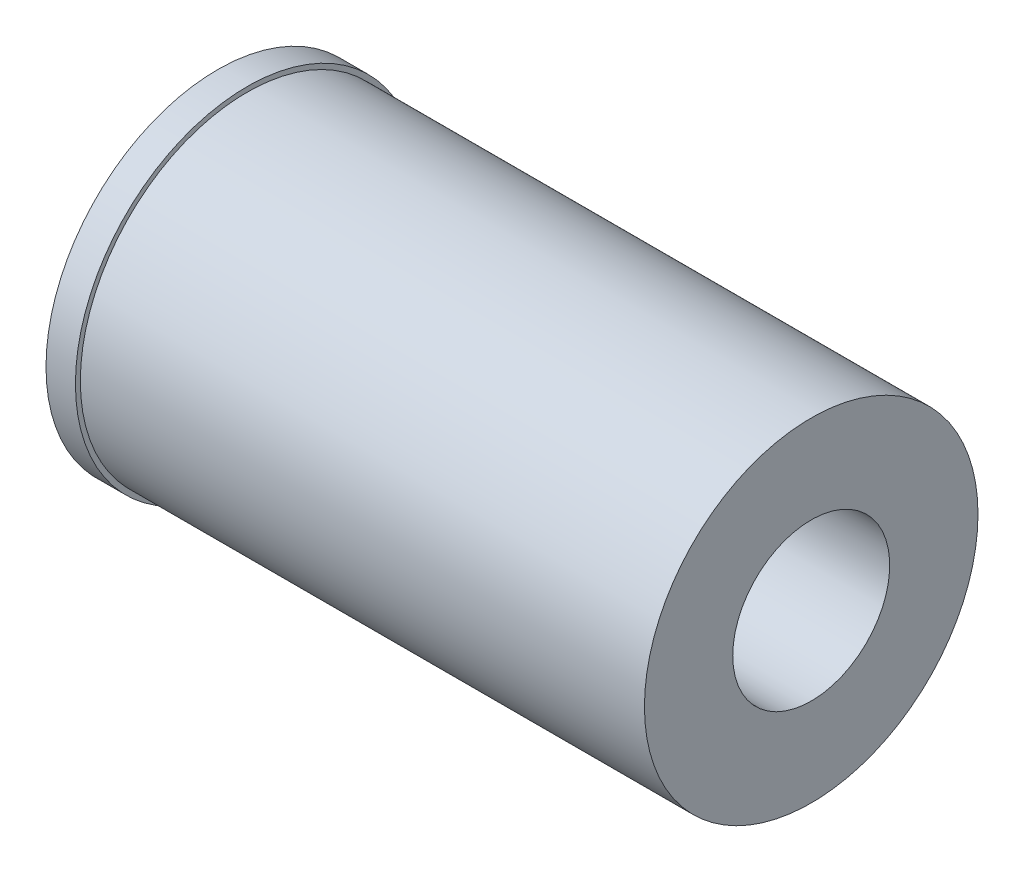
from build123d import *


with BuildPart() as part:
    # Esquisse1 → R_volution1 (revolve)
    with BuildSketch(Plane.XY, mode=Mode.PRIVATE) as r_volution1_sk:
        Polygon((0, 0), (0, 3.5), (0.6, 3.5), (0.6, 3.4), (12.1, 3.4), (12.1, 1.6), (1.4, 1.6), (1.4, 0.8), (0.6, 0.8), (0.6, 0), align=None)
    revolve(r_volution1_sk.sketch.rotate(Axis((0, 0, 0), (1, 0, 0)), 90), axis=Axis((0, 0, 0), (1, 0, 0)))


solid = part.part
